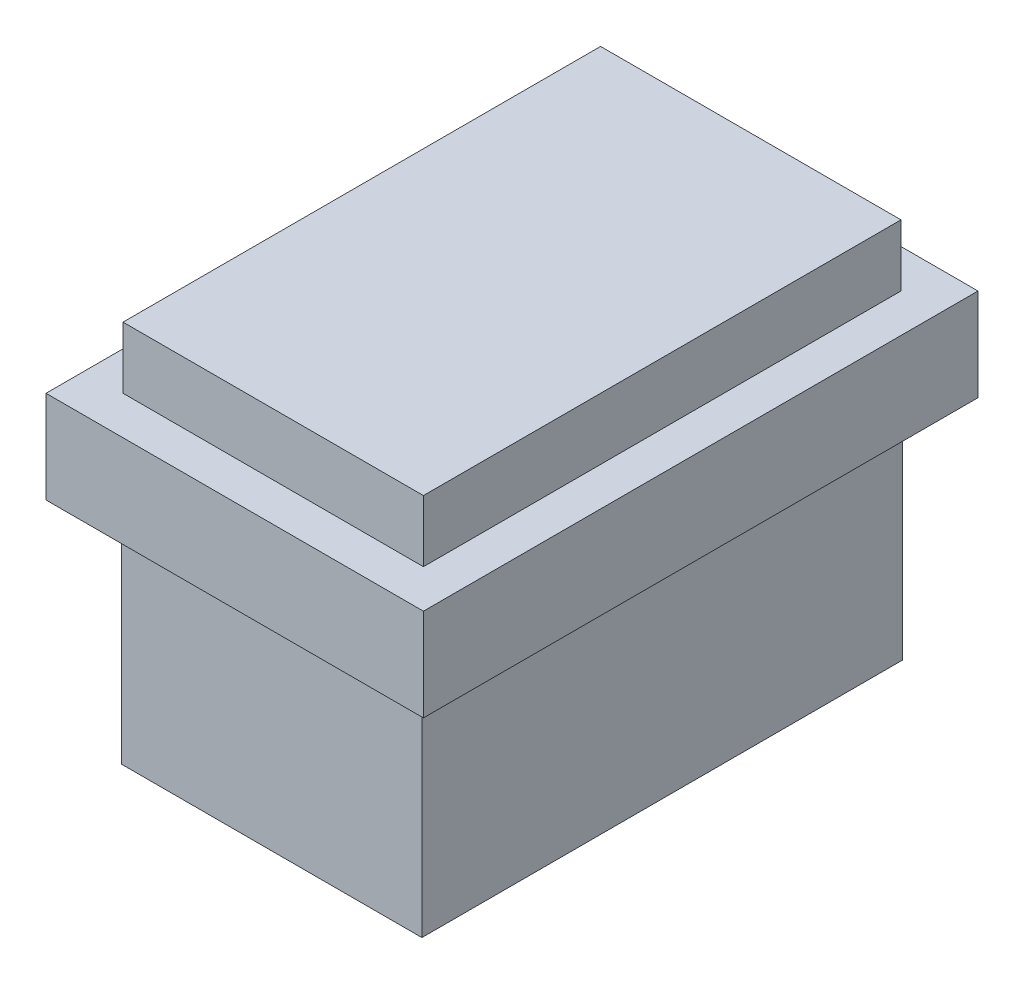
ISO-10303-21;
HEADER;
FILE_DESCRIPTION(('STEP AP214'),'2;1');
FILE_NAME('part.step','',(''),(''),'','','');
FILE_SCHEMA(('AUTOMOTIVE_DESIGN { 1 0 10303 214 1 1 1 1 }'));
ENDSEC;
DATA;
#1=APPLICATION_CONTEXT('core data for automotive mechanical design processes');
#2=APPLICATION_PROTOCOL_DEFINITION('international standard','automotive_design',2000,#1);
#3=PRODUCT_CONTEXT('',#1,'mechanical');
#4=PRODUCT('Part','Part','',(#3));
#5=PRODUCT_RELATED_PRODUCT_CATEGORY('part','',(#4));
#6=PRODUCT_DEFINITION_FORMATION('','',#4);
#7=PRODUCT_DEFINITION_CONTEXT('part definition',#1,'design');
#8=PRODUCT_DEFINITION('design','',#6,#7);
#9=PRODUCT_DEFINITION_SHAPE('','',#8);
#10=(LENGTH_UNIT() NAMED_UNIT(*) SI_UNIT(.MILLI.,.METRE.));
#11=(NAMED_UNIT(*) PLANE_ANGLE_UNIT() SI_UNIT($,.RADIAN.));
#12=(NAMED_UNIT(*) SI_UNIT($,.STERADIAN.) SOLID_ANGLE_UNIT());
#13=UNCERTAINTY_MEASURE_WITH_UNIT(LENGTH_MEASURE(1.E-05),#10,'distance_accuracy_value','');
#14=(GEOMETRIC_REPRESENTATION_CONTEXT(3) GLOBAL_UNCERTAINTY_ASSIGNED_CONTEXT((#13)) GLOBAL_UNIT_ASSIGNED_CONTEXT((#10,
#11,#12)) REPRESENTATION_CONTEXT('',''));
#15=CARTESIAN_POINT('',(0.,0.,0.));
#16=DIRECTION('',(0.,0.,1.));
#17=DIRECTION('',(1.,0.,0.));
#18=AXIS2_PLACEMENT_3D('',#15,#16,#17);
#19=CARTESIAN_POINT('',(-155.575,264.16,-228.6));
#20=DIRECTION('',(0.,-1.,0.));
#21=DIRECTION('',(0.,0.,-1.));
#22=AXIS2_PLACEMENT_3D('',#19,#20,#21);
#23=PLANE('',#22);
#24=DIRECTION('',(0.,0.,1.));
#25=VECTOR('',#24,1.);
#26=CARTESIAN_POINT('',(-155.575,264.16,228.6));
#27=LINE('',#26,#25);
#28=CARTESIAN_POINT('',(-155.575,264.16,-228.6));
#29=VERTEX_POINT('',#28);
#30=CARTESIAN_POINT('',(-155.575,264.16,228.6));
#31=VERTEX_POINT('',#30);
#32=EDGE_CURVE('E170',#29,#31,#27,.T.);
#33=ORIENTED_EDGE('',*,*,#32,.T.);
#34=DIRECTION('',(1.,0.,0.));
#35=VECTOR('',#34,1.);
#36=CARTESIAN_POINT('',(-155.575,264.16,228.6));
#37=LINE('',#36,#35);
#38=CARTESIAN_POINT('',(155.575,264.16,228.6));
#39=VERTEX_POINT('',#38);
#40=EDGE_CURVE('E173',#31,#39,#37,.T.);
#41=ORIENTED_EDGE('',*,*,#40,.T.);
#42=DIRECTION('',(0.,0.,-1.));
#43=VECTOR('',#42,1.);
#44=CARTESIAN_POINT('',(155.575,264.16,228.6));
#45=LINE('',#44,#43);
#46=CARTESIAN_POINT('',(155.575,264.16,-228.6));
#47=VERTEX_POINT('',#46);
#48=EDGE_CURVE('E176',#39,#47,#45,.T.);
#49=ORIENTED_EDGE('',*,*,#48,.T.);
#50=DIRECTION('',(-1.,0.,0.));
#51=VECTOR('',#50,1.);
#52=CARTESIAN_POINT('',(-155.575,264.16,-228.6));
#53=LINE('',#52,#51);
#54=EDGE_CURVE('E178',#47,#29,#53,.T.);
#55=ORIENTED_EDGE('',*,*,#54,.T.);
#56=EDGE_LOOP('',(#33,#41,#49,#55));
#57=FACE_BOUND('',#56,.T.);
#58=DIRECTION('',(0.,0.,-1.));
#59=VECTOR('',#58,1.);
#60=CARTESIAN_POINT('',(123.825,264.16,196.85));
#61=LINE('',#60,#59);
#62=CARTESIAN_POINT('',(123.825,264.16,196.85));
#63=VERTEX_POINT('',#62);
#64=CARTESIAN_POINT('',(123.825,264.16,-196.85));
#65=VERTEX_POINT('',#64);
#66=EDGE_CURVE('E133',#63,#65,#61,.T.);
#67=ORIENTED_EDGE('',*,*,#66,.F.);
#68=DIRECTION('',(-1.,0.,0.));
#69=VECTOR('',#68,1.);
#70=CARTESIAN_POINT('',(123.825,264.16,196.85));
#71=LINE('',#70,#69);
#72=CARTESIAN_POINT('',(-123.825,264.16,196.85));
#73=VERTEX_POINT('',#72);
#74=EDGE_CURVE('E144',#63,#73,#71,.T.);
#75=ORIENTED_EDGE('',*,*,#74,.T.);
#76=DIRECTION('',(0.,0.,-1.));
#77=VECTOR('',#76,1.);
#78=CARTESIAN_POINT('',(-123.825,264.16,196.85));
#79=LINE('',#78,#77);
#80=CARTESIAN_POINT('',(-123.825,264.16,-196.85));
#81=VERTEX_POINT('',#80);
#82=EDGE_CURVE('E161',#73,#81,#79,.T.);
#83=ORIENTED_EDGE('',*,*,#82,.T.);
#84=DIRECTION('',(-1.,0.,0.));
#85=VECTOR('',#84,1.);
#86=CARTESIAN_POINT('',(123.825,264.16,-196.85));
#87=LINE('',#86,#85);
#88=EDGE_CURVE('E151',#65,#81,#87,.T.);
#89=ORIENTED_EDGE('',*,*,#88,.F.);
#90=EDGE_LOOP('',(#67,#75,#83,#89));
#91=FACE_BOUND('',#90,.T.);
#92=ADVANCED_FACE('F31',(#57,#91),#23,.F.);
#93=CARTESIAN_POINT('',(123.825,0.,198.12));
#94=DIRECTION('',(0.,0.,-1.));
#95=DIRECTION('',(0.,1.,0.));
#96=AXIS2_PLACEMENT_3D('',#93,#94,#95);
#97=PLANE('',#96);
#98=DIRECTION('',(0.,-1.,0.));
#99=VECTOR('',#98,1.);
#100=CARTESIAN_POINT('',(-123.825,0.,198.12));
#101=LINE('',#100,#99);
#102=CARTESIAN_POINT('',(-123.825,187.96,198.12));
#103=VERTEX_POINT('',#102);
#104=CARTESIAN_POINT('',(-123.825,0.,198.12));
#105=VERTEX_POINT('',#104);
#106=EDGE_CURVE('E199',#103,#105,#101,.T.);
#107=ORIENTED_EDGE('',*,*,#106,.T.);
#108=DIRECTION('',(-1.,0.,0.));
#109=VECTOR('',#108,1.);
#110=CARTESIAN_POINT('',(123.825,0.,198.12));
#111=LINE('',#110,#109);
#112=CARTESIAN_POINT('',(123.825,0.,198.12));
#113=VERTEX_POINT('',#112);
#114=EDGE_CURVE('E11',#113,#105,#111,.T.);
#115=ORIENTED_EDGE('',*,*,#114,.F.);
#116=DIRECTION('',(0.,-1.,0.));
#117=VECTOR('',#116,1.);
#118=CARTESIAN_POINT('',(123.825,0.,198.12));
#119=LINE('',#118,#117);
#120=CARTESIAN_POINT('',(123.825,187.96,198.12));
#121=VERTEX_POINT('',#120);
#122=EDGE_CURVE('E200',#121,#113,#119,.T.);
#123=ORIENTED_EDGE('',*,*,#122,.F.);
#124=DIRECTION('',(-1.,0.,0.));
#125=VECTOR('',#124,1.);
#126=CARTESIAN_POINT('',(123.825,187.96,198.12));
#127=LINE('',#126,#125);
#128=EDGE_CURVE('E207',#121,#103,#127,.T.);
#129=ORIENTED_EDGE('',*,*,#128,.T.);
#130=EDGE_LOOP('',(#107,#115,#123,#129));
#131=FACE_BOUND('',#130,.T.);
#132=ADVANCED_FACE('F33',(#131),#97,.F.);
#133=CARTESIAN_POINT('',(123.825,0.,198.12));
#134=DIRECTION('',(0.,1.,0.));
#135=DIRECTION('',(0.,0.,1.));
#136=AXIS2_PLACEMENT_3D('',#133,#134,#135);
#137=PLANE('',#136);
#138=DIRECTION('',(0.,0.,-1.));
#139=VECTOR('',#138,1.);
#140=CARTESIAN_POINT('',(-123.825,0.,198.12));
#141=LINE('',#140,#139);
#142=CARTESIAN_POINT('',(-123.825,0.,-198.12));
#143=VERTEX_POINT('',#142);
#144=EDGE_CURVE('E210',#105,#143,#141,.T.);
#145=ORIENTED_EDGE('',*,*,#144,.T.);
#146=DIRECTION('',(-1.,0.,0.));
#147=VECTOR('',#146,1.);
#148=CARTESIAN_POINT('',(123.825,0.,-198.12));
#149=LINE('',#148,#147);
#150=CARTESIAN_POINT('',(123.825,0.,-198.12));
#151=VERTEX_POINT('',#150);
#152=EDGE_CURVE('E39',#151,#143,#149,.T.);
#153=ORIENTED_EDGE('',*,*,#152,.F.);
#154=DIRECTION('',(0.,0.,-1.));
#155=VECTOR('',#154,1.);
#156=CARTESIAN_POINT('',(123.825,0.,198.12));
#157=LINE('',#156,#155);
#158=EDGE_CURVE('E81',#113,#151,#157,.T.);
#159=ORIENTED_EDGE('',*,*,#158,.F.);
#160=ORIENTED_EDGE('',*,*,#114,.T.);
#161=EDGE_LOOP('',(#145,#153,#159,#160));
#162=FACE_BOUND('',#161,.T.);
#163=ADVANCED_FACE('F236',(#162),#137,.F.);
#164=CARTESIAN_POINT('',(123.825,0.,-198.12));
#165=DIRECTION('',(0.,0.,1.));
#166=DIRECTION('',(0.,-1.,0.));
#167=AXIS2_PLACEMENT_3D('',#164,#165,#166);
#168=PLANE('',#167);
#169=DIRECTION('',(0.,1.,0.));
#170=VECTOR('',#169,1.);
#171=CARTESIAN_POINT('',(-123.825,0.,-198.12));
#172=LINE('',#171,#170);
#173=CARTESIAN_POINT('',(-123.825,187.96,-198.12));
#174=VERTEX_POINT('',#173);
#175=EDGE_CURVE('E74',#143,#174,#172,.T.);
#176=ORIENTED_EDGE('',*,*,#175,.T.);
#177=DIRECTION('',(-1.,0.,0.));
#178=VECTOR('',#177,1.);
#179=CARTESIAN_POINT('',(123.825,187.96,-198.12));
#180=LINE('',#179,#178);
#181=CARTESIAN_POINT('',(123.825,187.96,-198.12));
#182=VERTEX_POINT('',#181);
#183=EDGE_CURVE('E217',#182,#174,#180,.T.);
#184=ORIENTED_EDGE('',*,*,#183,.F.);
#185=DIRECTION('',(0.,1.,0.));
#186=VECTOR('',#185,1.);
#187=CARTESIAN_POINT('',(123.825,0.,-198.12));
#188=LINE('',#187,#186);
#189=EDGE_CURVE('E204',#151,#182,#188,.T.);
#190=ORIENTED_EDGE('',*,*,#189,.F.);
#191=ORIENTED_EDGE('',*,*,#152,.T.);
#192=EDGE_LOOP('',(#176,#184,#190,#191));
#193=FACE_BOUND('',#192,.T.);
#194=ADVANCED_FACE('F220',(#193),#168,.F.);
#195=CARTESIAN_POINT('',(123.825,187.96,198.12));
#196=DIRECTION('',(-1.,0.,0.));
#197=DIRECTION('',(0.,0.,1.));
#198=AXIS2_PLACEMENT_3D('',#195,#196,#197);
#199=PLANE('',#198);
#200=ORIENTED_EDGE('',*,*,#122,.T.);
#201=ORIENTED_EDGE('',*,*,#158,.T.);
#202=ORIENTED_EDGE('',*,*,#189,.T.);
#203=DIRECTION('',(0.,0.,1.));
#204=VECTOR('',#203,1.);
#205=CARTESIAN_POINT('',(123.825,187.96,198.12));
#206=LINE('',#205,#204);
#207=EDGE_CURVE('E55',#182,#121,#206,.T.);
#208=ORIENTED_EDGE('',*,*,#207,.T.);
#209=EDGE_LOOP('',(#200,#201,#202,#208));
#210=FACE_BOUND('',#209,.T.);
#211=ADVANCED_FACE('F228',(#210),#199,.F.);
#212=CARTESIAN_POINT('',(-123.825,187.96,198.12));
#213=DIRECTION('',(-1.,0.,0.));
#214=DIRECTION('',(0.,0.,1.));
#215=AXIS2_PLACEMENT_3D('',#212,#213,#214);
#216=PLANE('',#215);
#217=ORIENTED_EDGE('',*,*,#106,.F.);
#218=DIRECTION('',(0.,0.,1.));
#219=VECTOR('',#218,1.);
#220=CARTESIAN_POINT('',(-123.825,187.96,198.12));
#221=LINE('',#220,#219);
#222=EDGE_CURVE('E202',#174,#103,#221,.T.);
#223=ORIENTED_EDGE('',*,*,#222,.F.);
#224=ORIENTED_EDGE('',*,*,#175,.F.);
#225=ORIENTED_EDGE('',*,*,#144,.F.);
#226=EDGE_LOOP('',(#217,#223,#224,#225));
#227=FACE_BOUND('',#226,.T.);
#228=ADVANCED_FACE('F222',(#227),#216,.T.);
#229=CARTESIAN_POINT('',(-155.575,187.96,-228.6));
#230=DIRECTION('',(0.,-1.,0.));
#231=DIRECTION('',(0.,0.,-1.));
#232=AXIS2_PLACEMENT_3D('',#229,#230,#231);
#233=PLANE('',#232);
#234=DIRECTION('',(0.,0.,1.));
#235=VECTOR('',#234,1.);
#236=CARTESIAN_POINT('',(-155.575,187.96,228.6));
#237=LINE('',#236,#235);
#238=CARTESIAN_POINT('',(-155.575,187.96,-228.6));
#239=VERTEX_POINT('',#238);
#240=CARTESIAN_POINT('',(-155.575,187.96,228.6));
#241=VERTEX_POINT('',#240);
#242=EDGE_CURVE('E150',#239,#241,#237,.T.);
#243=ORIENTED_EDGE('',*,*,#242,.F.);
#244=DIRECTION('',(-1.,0.,0.));
#245=VECTOR('',#244,1.);
#246=CARTESIAN_POINT('',(-155.575,187.96,-228.6));
#247=LINE('',#246,#245);
#248=CARTESIAN_POINT('',(155.575,187.96,-228.6));
#249=VERTEX_POINT('',#248);
#250=EDGE_CURVE('E174',#249,#239,#247,.T.);
#251=ORIENTED_EDGE('',*,*,#250,.F.);
#252=DIRECTION('',(0.,0.,-1.));
#253=VECTOR('',#252,1.);
#254=CARTESIAN_POINT('',(155.575,187.96,228.6));
#255=LINE('',#254,#253);
#256=CARTESIAN_POINT('',(155.575,187.96,228.6));
#257=VERTEX_POINT('',#256);
#258=EDGE_CURVE('E185',#257,#249,#255,.T.);
#259=ORIENTED_EDGE('',*,*,#258,.F.);
#260=DIRECTION('',(1.,0.,0.));
#261=VECTOR('',#260,1.);
#262=CARTESIAN_POINT('',(-155.575,187.96,228.6));
#263=LINE('',#262,#261);
#264=EDGE_CURVE('E183',#241,#257,#263,.T.);
#265=ORIENTED_EDGE('',*,*,#264,.F.);
#266=EDGE_LOOP('',(#243,#251,#259,#265));
#267=FACE_BOUND('',#266,.T.);
#268=ORIENTED_EDGE('',*,*,#207,.F.);
#269=ORIENTED_EDGE('',*,*,#183,.T.);
#270=ORIENTED_EDGE('',*,*,#222,.T.);
#271=ORIENTED_EDGE('',*,*,#128,.F.);
#272=EDGE_LOOP('',(#268,#269,#270,#271));
#273=FACE_BOUND('',#272,.T.);
#274=ADVANCED_FACE('F225',(#267,#273),#233,.T.);
#275=CARTESIAN_POINT('',(-155.575,264.16,228.6));
#276=DIRECTION('',(1.,0.,0.));
#277=DIRECTION('',(0.,0.,-1.));
#278=AXIS2_PLACEMENT_3D('',#275,#276,#277);
#279=PLANE('',#278);
#280=ORIENTED_EDGE('',*,*,#242,.T.);
#281=DIRECTION('',(0.,-1.,0.));
#282=VECTOR('',#281,1.);
#283=CARTESIAN_POINT('',(-155.575,264.16,228.6));
#284=LINE('',#283,#282);
#285=EDGE_CURVE('E196',#31,#241,#284,.T.);
#286=ORIENTED_EDGE('',*,*,#285,.F.);
#287=ORIENTED_EDGE('',*,*,#32,.F.);
#288=DIRECTION('',(0.,-1.,0.));
#289=VECTOR('',#288,1.);
#290=CARTESIAN_POINT('',(-155.575,264.16,-228.6));
#291=LINE('',#290,#289);
#292=EDGE_CURVE('E180',#29,#239,#291,.T.);
#293=ORIENTED_EDGE('',*,*,#292,.T.);
#294=EDGE_LOOP('',(#280,#286,#287,#293));
#295=FACE_BOUND('',#294,.T.);
#296=ADVANCED_FACE('F250',(#295),#279,.F.);
#297=CARTESIAN_POINT('',(-155.575,264.16,228.6));
#298=DIRECTION('',(0.,0.,-1.));
#299=DIRECTION('',(-1.,0.,0.));
#300=AXIS2_PLACEMENT_3D('',#297,#298,#299);
#301=PLANE('',#300);
#302=ORIENTED_EDGE('',*,*,#264,.T.);
#303=DIRECTION('',(0.,-1.,0.));
#304=VECTOR('',#303,1.);
#305=CARTESIAN_POINT('',(155.575,264.16,228.6));
#306=LINE('',#305,#304);
#307=EDGE_CURVE('E193',#39,#257,#306,.T.);
#308=ORIENTED_EDGE('',*,*,#307,.F.);
#309=ORIENTED_EDGE('',*,*,#40,.F.);
#310=ORIENTED_EDGE('',*,*,#285,.T.);
#311=EDGE_LOOP('',(#302,#308,#309,#310));
#312=FACE_BOUND('',#311,.T.);
#313=ADVANCED_FACE('F259',(#312),#301,.F.);
#314=CARTESIAN_POINT('',(155.575,264.16,228.6));
#315=DIRECTION('',(-1.,0.,0.));
#316=DIRECTION('',(0.,0.,1.));
#317=AXIS2_PLACEMENT_3D('',#314,#315,#316);
#318=PLANE('',#317);
#319=ORIENTED_EDGE('',*,*,#258,.T.);
#320=DIRECTION('',(0.,-1.,0.));
#321=VECTOR('',#320,1.);
#322=CARTESIAN_POINT('',(155.575,264.16,-228.6));
#323=LINE('',#322,#321);
#324=EDGE_CURVE('E190',#47,#249,#323,.T.);
#325=ORIENTED_EDGE('',*,*,#324,.F.);
#326=ORIENTED_EDGE('',*,*,#48,.F.);
#327=ORIENTED_EDGE('',*,*,#307,.T.);
#328=EDGE_LOOP('',(#319,#325,#326,#327));
#329=FACE_BOUND('',#328,.T.);
#330=ADVANCED_FACE('F255',(#329),#318,.F.);
#331=CARTESIAN_POINT('',(-155.575,264.16,-228.6));
#332=DIRECTION('',(0.,0.,1.));
#333=DIRECTION('',(1.,0.,0.));
#334=AXIS2_PLACEMENT_3D('',#331,#332,#333);
#335=PLANE('',#334);
#336=ORIENTED_EDGE('',*,*,#250,.T.);
#337=ORIENTED_EDGE('',*,*,#292,.F.);
#338=ORIENTED_EDGE('',*,*,#54,.F.);
#339=ORIENTED_EDGE('',*,*,#324,.T.);
#340=EDGE_LOOP('',(#336,#337,#338,#339));
#341=FACE_BOUND('',#340,.T.);
#342=ADVANCED_FACE('F252',(#341),#335,.F.);
#343=CARTESIAN_POINT('',(123.825,264.16,196.85));
#344=DIRECTION('',(0.,0.,-1.));
#345=DIRECTION('',(-1.,0.,0.));
#346=AXIS2_PLACEMENT_3D('',#343,#344,#345);
#347=PLANE('',#346);
#348=DIRECTION('',(0.,-1.,0.));
#349=VECTOR('',#348,1.);
#350=CARTESIAN_POINT('',(-123.825,264.16,196.85));
#351=LINE('',#350,#349);
#352=CARTESIAN_POINT('',(-123.825,314.96,196.85));
#353=VERTEX_POINT('',#352);
#354=EDGE_CURVE('E147',#353,#73,#351,.T.);
#355=ORIENTED_EDGE('',*,*,#354,.T.);
#356=ORIENTED_EDGE('',*,*,#74,.F.);
#357=DIRECTION('',(0.,-1.,0.));
#358=VECTOR('',#357,1.);
#359=CARTESIAN_POINT('',(123.825,264.16,196.85));
#360=LINE('',#359,#358);
#361=CARTESIAN_POINT('',(123.825,314.96,196.85));
#362=VERTEX_POINT('',#361);
#363=EDGE_CURVE('E129',#362,#63,#360,.T.);
#364=ORIENTED_EDGE('',*,*,#363,.F.);
#365=DIRECTION('',(-1.,0.,0.));
#366=VECTOR('',#365,1.);
#367=CARTESIAN_POINT('',(123.825,314.96,196.85));
#368=LINE('',#367,#366);
#369=EDGE_CURVE('E159',#362,#353,#368,.T.);
#370=ORIENTED_EDGE('',*,*,#369,.T.);
#371=EDGE_LOOP('',(#355,#356,#364,#370));
#372=FACE_BOUND('',#371,.T.);
#373=ADVANCED_FACE('F145',(#372),#347,.F.);
#374=CARTESIAN_POINT('',(123.825,264.16,-196.85));
#375=DIRECTION('',(0.,0.,1.));
#376=DIRECTION('',(1.,0.,0.));
#377=AXIS2_PLACEMENT_3D('',#374,#375,#376);
#378=PLANE('',#377);
#379=DIRECTION('',(0.,1.,0.));
#380=VECTOR('',#379,1.);
#381=CARTESIAN_POINT('',(-123.825,264.16,-196.85));
#382=LINE('',#381,#380);
#383=CARTESIAN_POINT('',(-123.825,314.96,-196.85));
#384=VERTEX_POINT('',#383);
#385=EDGE_CURVE('E46',#81,#384,#382,.T.);
#386=ORIENTED_EDGE('',*,*,#385,.T.);
#387=DIRECTION('',(-1.,0.,0.));
#388=VECTOR('',#387,1.);
#389=CARTESIAN_POINT('',(123.825,314.96,-196.85));
#390=LINE('',#389,#388);
#391=CARTESIAN_POINT('',(123.825,314.96,-196.85));
#392=VERTEX_POINT('',#391);
#393=EDGE_CURVE('E166',#392,#384,#390,.T.);
#394=ORIENTED_EDGE('',*,*,#393,.F.);
#395=DIRECTION('',(0.,1.,0.));
#396=VECTOR('',#395,1.);
#397=CARTESIAN_POINT('',(123.825,264.16,-196.85));
#398=LINE('',#397,#396);
#399=EDGE_CURVE('E154',#65,#392,#398,.T.);
#400=ORIENTED_EDGE('',*,*,#399,.F.);
#401=ORIENTED_EDGE('',*,*,#88,.T.);
#402=EDGE_LOOP('',(#386,#394,#400,#401));
#403=FACE_BOUND('',#402,.T.);
#404=ADVANCED_FACE('F297',(#403),#378,.F.);
#405=CARTESIAN_POINT('',(123.825,314.96,196.85));
#406=DIRECTION('',(0.,-1.,0.));
#407=DIRECTION('',(0.,0.,-1.));
#408=AXIS2_PLACEMENT_3D('',#405,#406,#407);
#409=PLANE('',#408);
#410=DIRECTION('',(0.,0.,1.));
#411=VECTOR('',#410,1.);
#412=CARTESIAN_POINT('',(-123.825,314.96,196.85));
#413=LINE('',#412,#411);
#414=EDGE_CURVE('E140',#384,#353,#413,.T.);
#415=ORIENTED_EDGE('',*,*,#414,.T.);
#416=ORIENTED_EDGE('',*,*,#369,.F.);
#417=DIRECTION('',(0.,0.,1.));
#418=VECTOR('',#417,1.);
#419=CARTESIAN_POINT('',(123.825,314.96,196.85));
#420=LINE('',#419,#418);
#421=EDGE_CURVE('E136',#392,#362,#420,.T.);
#422=ORIENTED_EDGE('',*,*,#421,.F.);
#423=ORIENTED_EDGE('',*,*,#393,.T.);
#424=EDGE_LOOP('',(#415,#416,#422,#423));
#425=FACE_BOUND('',#424,.T.);
#426=ADVANCED_FACE('F303',(#425),#409,.F.);
#427=CARTESIAN_POINT('',(123.825,314.96,196.85));
#428=DIRECTION('',(-1.,0.,0.));
#429=DIRECTION('',(0.,0.,1.));
#430=AXIS2_PLACEMENT_3D('',#427,#428,#429);
#431=PLANE('',#430);
#432=ORIENTED_EDGE('',*,*,#363,.T.);
#433=ORIENTED_EDGE('',*,*,#66,.T.);
#434=ORIENTED_EDGE('',*,*,#399,.T.);
#435=ORIENTED_EDGE('',*,*,#421,.T.);
#436=EDGE_LOOP('',(#432,#433,#434,#435));
#437=FACE_BOUND('',#436,.T.);
#438=ADVANCED_FACE('F131',(#437),#431,.F.);
#439=CARTESIAN_POINT('',(-123.825,314.96,196.85));
#440=DIRECTION('',(-1.,0.,0.));
#441=DIRECTION('',(0.,0.,1.));
#442=AXIS2_PLACEMENT_3D('',#439,#440,#441);
#443=PLANE('',#442);
#444=ORIENTED_EDGE('',*,*,#354,.F.);
#445=ORIENTED_EDGE('',*,*,#414,.F.);
#446=ORIENTED_EDGE('',*,*,#385,.F.);
#447=ORIENTED_EDGE('',*,*,#82,.F.);
#448=EDGE_LOOP('',(#444,#445,#446,#447));
#449=FACE_BOUND('',#448,.T.);
#450=ADVANCED_FACE('F317',(#449),#443,.T.);
#451=CLOSED_SHELL('',(#92,#132,#163,#194,#211,#228,#274,#296,#313,#330,#342,#373,#404,#426,#438,#450));
#452=MANIFOLD_SOLID_BREP('B2',#451);
#453=ADVANCED_BREP_SHAPE_REPRESENTATION('',(#18,#452),#14);
#454=SHAPE_DEFINITION_REPRESENTATION(#9,#453);
ENDSEC;
END-ISO-10303-21;
